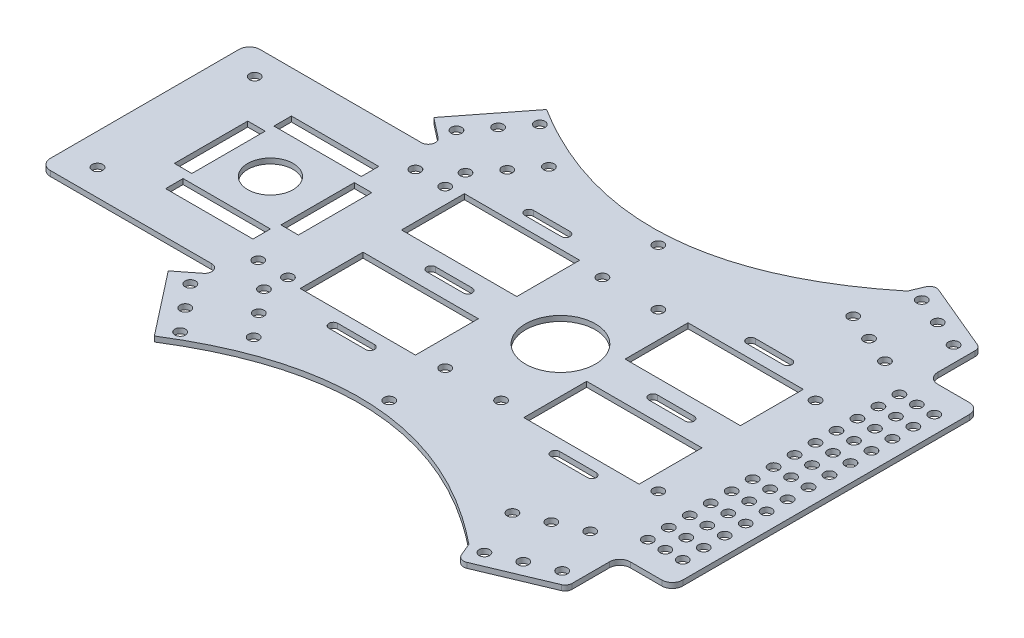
from build123d import *

# Parameters (mm, degrees)
EXTRUDE_2_DEPTH        = 1.5
SKETCH_5_R             = 6.5
SKETCH_5_W             = 5
SKETCH_5_H             = 21
SKETCH_5_W_2           = 25
SKETCH_5_H_2           = 5
CUT_EXTRUDE_1605_DEPTH = 207.41405532
SKETCH_6_R             = 10
SKETCH_6_W             = 33
SKETCH_6_H             = 18
CUT_EXTRUDE_2559_DEPTH = 207.41405532
SKETCH_7_R             = 1.5
CUT_EXTRUDE_2981_DEPTH = 207.41405532
SKETCH_8_R             = 1.5
CUT_EXTRUDE_3561_DEPTH = 207.41405532
SKETCH_9_R             = 1.5
CUT_EXTRUDE_4002_DEPTH = 207.41405532


with BuildPart() as part:
    # Sketch 1 → Extrude 2 (new body)
    with BuildSketch(Plane(origin=(0, 0, 0), x_dir=(1, 0, 0), z_dir=(0, 1, 0))):
        with BuildLine():
            Line((0, -27), (0, 27))
            ThreePointArc((0, 27), (0.878679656, 29.121320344), (3, 30))
            Line((3, 30), (49.188262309, 30))
            ThreePointArc((49.188262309, 30), (51.0794138, 31.349195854), (50.419031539, 33.576453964))
            Line((50.419031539, 33.576453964), (44.753049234, 38))
            Line((44.753049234, 38), (58.906895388, 56.129220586))
            add(Edge.make_bspline(
                [(58.906895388, 56.129220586), (108.824561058, 24.835581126), (155.548488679, 62.758137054)],
                knots=[0, 0, 0, 1, 1, 1], degree=2))
            Line((155.548488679, 62.758137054), (157.096883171, 66.446290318))
            ThreePointArc((157.096883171, 66.446290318), (158.184440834, 67.523492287), (159.715157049, 67.516169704))
            Line((159.715157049, 67.516169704), (178.774197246, 59.514627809))
            ThreePointArc((178.774197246, 59.514627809), (179.665592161, 58.777710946), (180, 57.670551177))
            Line((180, 57.670551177), (180, 47))
            ThreePointArc((180, 47), (180.878679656, 44.878679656), (183, 44))
            Line((183, 44), (192, 44))
            ThreePointArc((192, 44), (194.121320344, 43.121320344), (195, 41))
            Line((195, 41), (195, -41))
            ThreePointArc((195, -41), (194.121320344, -43.121320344), (192, -44))
            Line((192, -44), (183, -44))
            ThreePointArc((183, -44), (180.878679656, -44.878679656), (180, -47))
            Line((180, -47), (180, -57.670551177))
            ThreePointArc((180, -57.670551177), (179.665592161, -58.777710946), (178.774197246, -59.514627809))
            Line((178.774197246, -59.514627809), (159.715157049, -67.516169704))
            ThreePointArc((159.715157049, -67.516169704), (158.184440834, -67.523492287), (157.096883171, -66.446290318))
            Line((157.096883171, -66.446290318), (155.548488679, -62.758137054))
            add(Edge.make_bspline(
                [(58.906895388, -56.129220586), (108.824561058, -24.835581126), (155.548488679, -62.758137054)],
                knots=[0, 0, 0, 1, 1, 1], degree=2))
            Line((58.906895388, -56.129220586), (44.753049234, -38))
            Line((44.753049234, -38), (50.419031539, -33.576453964))
            ThreePointArc((50.419031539, -33.576453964), (51.0794138, -31.349195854), (49.188262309, -30))
            Line((49.188262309, -30), (3, -30))
            ThreePointArc((3, -30), (0.878679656, -29.121320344), (0, -27))
        make_face()
    extrude(amount=EXTRUDE_2_DEPTH)

    # Sketch 5 → Cut-Extrude 1605 (cut, through all)
    with BuildSketch(Plane(origin=(0, 1.5, 0), x_dir=(1, 0, 0), z_dir=(0, 1, 0))):
        with Locations(Location((36, 0, 0), (0, 0, 270))):
            Circle(SKETCH_5_R)
        with Locations((21.5, 0)):
            Rectangle(SKETCH_5_W, SKETCH_5_H)
        with Locations((52, 0)):
            Rectangle(SKETCH_5_W, SKETCH_5_H)
        with Locations((36.5, 15.5)):
            Rectangle(SKETCH_5_W_2, SKETCH_5_H_2)
        with Locations((36.5, -15.5)):
            Rectangle(SKETCH_5_W_2, SKETCH_5_H_2)
    extrude(amount=-CUT_EXTRUDE_1605_DEPTH, mode=Mode.SUBTRACT)

    # Sketch 6 → Cut-Extrude 2559 (cut, through all)
    with BuildSketch(Plane(origin=(0, 1.5, 0), x_dir=(1, 0, 0), z_dir=(0, 1, 0))):
        with Locations(Location((119, 0, 0), (0, 0, 270))):
            Circle(SKETCH_6_R)
        with Locations((84.5, 14.5)):
            Rectangle(SKETCH_6_W, SKETCH_6_H)
        with Locations((148.5, 14.5)):
            Rectangle(SKETCH_6_W, SKETCH_6_H)
        with BuildLine():
            Line((145.5, 1.25), (156, 1.25))
            ThreePointArc((156, 1.25), (157.25, 0), (156, -1.25))
            Line((156, -1.25), (145.5, -1.25))
            ThreePointArc((145.5, -1.25), (144.25, 0), (145.5, 1.25))
        make_face()
        with BuildLine():
            Line((82, 1.25), (92.5, 1.25))
            ThreePointArc((92.5, 1.25), (93.75, 0), (92.5, -1.25))
            Line((92.5, -1.25), (82, -1.25))
            ThreePointArc((82, -1.25), (80.75, 0), (82, 1.25))
        make_face()
        with BuildLine():
            Line((145.5, 29.25), (156, 29.25))
            ThreePointArc((156, 29.25), (157.25, 28), (156, 26.75))
            Line((156, 26.75), (145.5, 26.75))
            ThreePointArc((145.5, 26.75), (144.25, 28), (145.5, 29.25))
        make_face()
        with BuildLine():
            Line((82, 29.25), (92.5, 29.25))
            ThreePointArc((92.5, 29.25), (93.75, 28), (92.5, 26.75))
            Line((92.5, 26.75), (82, 26.75))
            ThreePointArc((82, 26.75), (80.75, 28), (82, 29.25))
        make_face()
        with BuildLine():
            Line((145.5, -29.25), (156, -29.25))
            ThreePointArc((156, -29.25), (157.25, -28), (156, -26.75))
            Line((156, -26.75), (145.5, -26.75))
            ThreePointArc((145.5, -26.75), (144.25, -28), (145.5, -29.25))
        make_face()
        with BuildLine():
            Line((82, -29.25), (92.5, -29.25))
            ThreePointArc((92.5, -29.25), (93.75, -28), (92.5, -26.75))
            Line((92.5, -26.75), (82, -26.75))
            ThreePointArc((82, -26.75), (80.75, -28), (82, -29.25))
        make_face()
        with Locations((148.5, -14.5)):
            Rectangle(SKETCH_6_W, SKETCH_6_H)
        with Locations((84.5, -14.5)):
            Rectangle(SKETCH_6_W, SKETCH_6_H)
    extrude(amount=-CUT_EXTRUDE_2559_DEPTH, mode=Mode.SUBTRACT)

    # Sketch 7 → Cut-Extrude 2981 (cut, through all)
    with BuildSketch(Plane(origin=(0, 1.5, 0), x_dir=(1, 0, 0), z_dir=(0, 1, 0))):
        with Locations(Location((190, 36, 0), (0, 0, 270))):
            Circle(SKETCH_7_R)
        with Locations(Location((185, 36, 0), (0, 0, 270))):
            Circle(SKETCH_7_R)
        with Locations(Location((180, 36, 0), (0, 0, 270))):
            Circle(SKETCH_7_R)
        with Locations(Location((190, 30, 0), (0, 0, 270))):
            Circle(SKETCH_7_R)
        with Locations(Location((185, 30, 0), (0, 0, 270))):
            Circle(SKETCH_7_R)
        with Locations(Location((180, 30, 0), (0, 0, 270))):
            Circle(SKETCH_7_R)
        with Locations(Location((190, 24, 0), (0, 0, 270))):
            Circle(SKETCH_7_R)
        with Locations(Location((185, 24, 0), (0, 0, 270))):
            Circle(SKETCH_7_R)
        with Locations(Location((180, 24, 0), (0, 0, 270))):
            Circle(SKETCH_7_R)
        with Locations(Location((190, 18, 0), (0, 0, 270))):
            Circle(SKETCH_7_R)
        with Locations(Location((185, 18, 0), (0, 0, 270))):
            Circle(SKETCH_7_R)
        with Locations(Location((180, 18, 0), (0, 0, 270))):
            Circle(SKETCH_7_R)
        with Locations(Location((190, 12, 0), (0, 0, 270))):
            Circle(SKETCH_7_R)
        with Locations(Location((185, 12, 0), (0, 0, 270))):
            Circle(SKETCH_7_R)
        with Locations(Location((180, 12, 0), (0, 0, 270))):
            Circle(SKETCH_7_R)
        with Locations(Location((190, 6, 0), (0, 0, 270))):
            Circle(SKETCH_7_R)
        with Locations(Location((185, 6, 0), (0, 0, 270))):
            Circle(SKETCH_7_R)
        with Locations(Location((180, 6, 0), (0, 0, 270))):
            Circle(SKETCH_7_R)
        with Locations(Location((190, 0, 0), (0, 0, 270))):
            Circle(SKETCH_7_R)
        with Locations(Location((185, 0, 0), (0, 0, 270))):
            Circle(SKETCH_7_R)
        with Locations(Location((180, 0, 0), (0, 0, 270))):
            Circle(SKETCH_7_R)
        with Locations(Location((190, -6, 0), (0, 0, 270))):
            Circle(SKETCH_7_R)
        with Locations(Location((185, -6, 0), (0, 0, 270))):
            Circle(SKETCH_7_R)
        with Locations(Location((180, -6, 0), (0, 0, 270))):
            Circle(SKETCH_7_R)
        with Locations(Location((190, -12, 0), (0, 0, 270))):
            Circle(SKETCH_7_R)
        with Locations(Location((185, -12, 0), (0, 0, 270))):
            Circle(SKETCH_7_R)
        with Locations(Location((180, -12, 0), (0, 0, 270))):
            Circle(SKETCH_7_R)
        with Locations(Location((190, -18, 0), (0, 0, 270))):
            Circle(SKETCH_7_R)
        with Locations(Location((185, -18, 0), (0, 0, 270))):
            Circle(SKETCH_7_R)
        with Locations(Location((180, -18, 0), (0, 0, 270))):
            Circle(SKETCH_7_R)
        with Locations(Location((190, -24, 0), (0, 0, 270))):
            Circle(SKETCH_7_R)
        with Locations(Location((185, -24, 0), (0, 0, 270))):
            Circle(SKETCH_7_R)
        with Locations(Location((180, -24, 0), (0, 0, 270))):
            Circle(SKETCH_7_R)
        with Locations(Location((190, -30, 0), (0, 0, 270))):
            Circle(SKETCH_7_R)
        with Locations(Location((185, -30, 0), (0, 0, 270))):
            Circle(SKETCH_7_R)
        with Locations(Location((180, -30, 0), (0, 0, 270))):
            Circle(SKETCH_7_R)
        with Locations(Location((190, -36, 0), (0, 0, 270))):
            Circle(SKETCH_7_R)
        with Locations(Location((185, -36, 0), (0, 0, 270))):
            Circle(SKETCH_7_R)
        with Locations(Location((180, -36, 0), (0, 0, 270))):
            Circle(SKETCH_7_R)
    extrude(amount=-CUT_EXTRUDE_2981_DEPTH, mode=Mode.SUBTRACT)

    # Sketch 8 → Cut-Extrude 3561 (cut, through all)
    with BuildSketch(Plane(origin=(0, 1.5, 0), x_dir=(1, 0, 0), z_dir=(0, 1, 0))):
        with Locations(Location((51.155722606, 38.075984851, 0), (0, 0, 270))):
            Circle(SKETCH_8_R)
        with Locations(Location((56.386491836, 44.775914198, 0), (0, 0, 270))):
            Circle(SKETCH_8_R)
        with Locations(Location((61.617261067, 51.475843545, 0), (0, 0, 270))):
            Circle(SKETCH_8_R)
        with Locations(Location((62.979127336, 28.84521562, 0), (0, 0, 270))):
            Circle(SKETCH_8_R)
        with Locations(Location((68.209896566, 35.545144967, 0), (0, 0, 270))):
            Circle(SKETCH_8_R)
        with Locations(Location((73.440665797, 42.245074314, 0), (0, 0, 270))):
            Circle(SKETCH_8_R)
        with Locations(Location((159.817289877, 62.592800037, 0), (0, 0, 270))):
            Circle(SKETCH_8_R)
        with Locations(Location((167.654615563, 59.302461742, 0), (0, 0, 270))):
            Circle(SKETCH_8_R)
        with Locations(Location((175.491941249, 56.012123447, 0), (0, 0, 270))):
            Circle(SKETCH_8_R)
        with Locations(Location((154.010810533, 48.762225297, 0), (0, 0, 270))):
            Circle(SKETCH_8_R)
        with Locations(Location((161.848136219, 45.471887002, 0), (0, 0, 270))):
            Circle(SKETCH_8_R)
        with Locations(Location((169.685461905, 42.181548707, 0), (0, 0, 270))):
            Circle(SKETCH_8_R)
        with Locations(Location((159.817289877, -62.592800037, 0), (0, 0, 90))):
            Circle(SKETCH_8_R)
        with Locations(Location((167.654615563, -59.302461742, 0), (0, 0, 90))):
            Circle(SKETCH_8_R)
        with Locations(Location((175.491941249, -56.012123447, 0), (0, 0, 90))):
            Circle(SKETCH_8_R)
        with Locations(Location((169.685461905, -42.181548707, 0), (0, 0, 90))):
            Circle(SKETCH_8_R)
        with Locations(Location((161.848136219, -45.471887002, 0), (0, 0, 90))):
            Circle(SKETCH_8_R)
        with Locations(Location((154.010810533, -48.762225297, 0), (0, 0, 90))):
            Circle(SKETCH_8_R)
        with Locations(Location((51.155722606, -38.075984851, 0), (0, 0, 90))):
            Circle(SKETCH_8_R)
        with Locations(Location((62.979127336, -28.84521562, 0), (0, 0, 90))):
            Circle(SKETCH_8_R)
        with Locations(Location((68.209896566, -35.545144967, 0), (0, 0, 90))):
            Circle(SKETCH_8_R)
        with Locations(Location((56.386491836, -44.775914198, 0), (0, 0, 90))):
            Circle(SKETCH_8_R)
        with Locations(Location((61.617261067, -51.475843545, 0), (0, 0, 90))):
            Circle(SKETCH_8_R)
        with Locations(Location((73.440665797, -42.245074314, 0), (0, 0, 90))):
            Circle(SKETCH_8_R)
    extrude(amount=-CUT_EXTRUDE_3561_DEPTH, mode=Mode.SUBTRACT)

    # Sketch 9 → Cut-Extrude 4002 (cut, through all)
    with BuildSketch(Plane(origin=(0, 1.5, 0), x_dir=(1, 0, 0), z_dir=(0, 1, 0))):
        with Locations(Location((9, 22.5, 0), (0, 0, 270))):
            Circle(SKETCH_9_R)
        with Locations(Location((63.5, 22.5, 0), (0, 0, 270))):
            Circle(SKETCH_9_R)
        with Locations(Location((55, 22.5, 0), (0, 0, 270))):
            Circle(SKETCH_9_R)
        with Locations(Location((108.5, 22.5, 0), (0, 0, 270))):
            Circle(SKETCH_9_R)
        with Locations(Location((124.5, 22.5, 0), (0, 0, 270))):
            Circle(SKETCH_9_R)
        with Locations(Location((169.5, 22.5, 0), (0, 0, 270))):
            Circle(SKETCH_9_R)
        with Locations(Location((108.5, 38.5, 0), (0, 0, 270))):
            Circle(SKETCH_9_R)
        with Locations(Location((169.5, -22.5, 0), (0, 0, 90))):
            Circle(SKETCH_9_R)
        with Locations(Location((124.5, -22.5, 0), (0, 0, 90))):
            Circle(SKETCH_9_R)
        with Locations(Location((108.5, -38.5, 0), (0, 0, 90))):
            Circle(SKETCH_9_R)
        with Locations(Location((108.5, -22.5, 0), (0, 0, 90))):
            Circle(SKETCH_9_R)
        with Locations(Location((63.5, -22.5, 0), (0, 0, 90))):
            Circle(SKETCH_9_R)
        with Locations(Location((55, -22.5, 0), (0, 0, 90))):
            Circle(SKETCH_9_R)
        with Locations(Location((9, -22.5, 0), (0, 0, 90))):
            Circle(SKETCH_9_R)
    extrude(amount=-CUT_EXTRUDE_4002_DEPTH, mode=Mode.SUBTRACT)


solid = part.part
